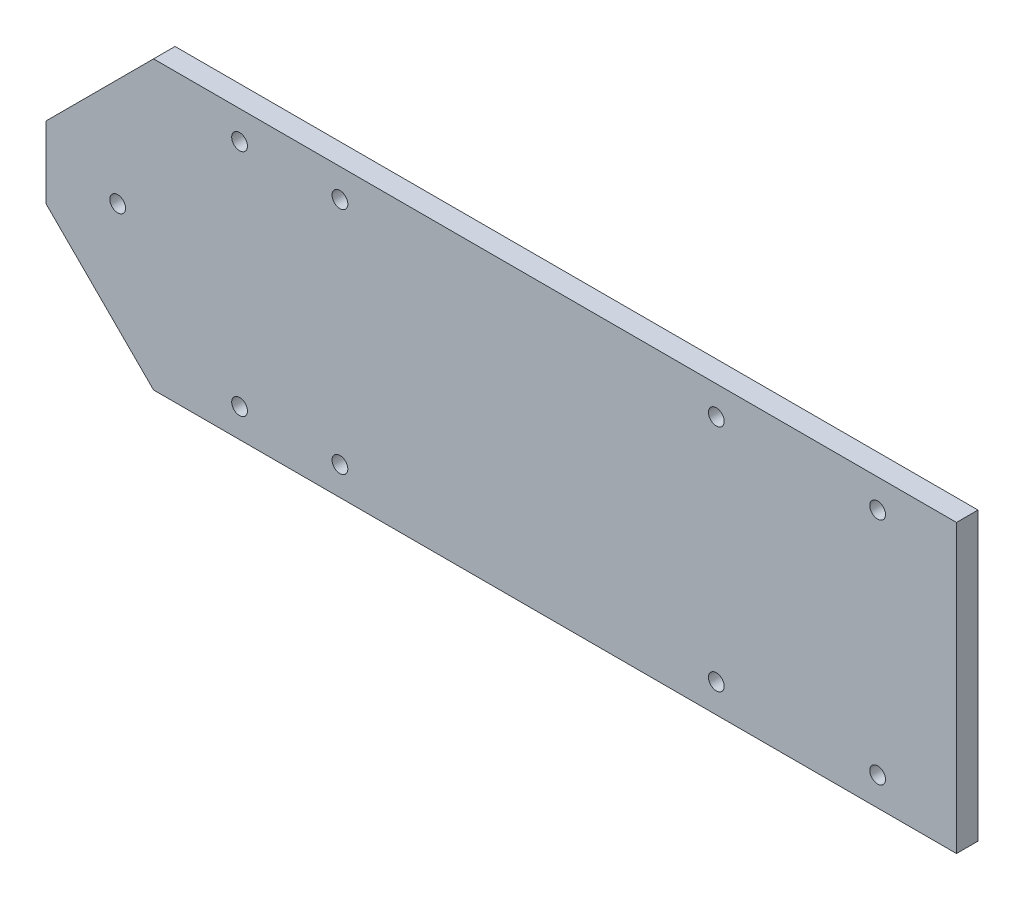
from build123d import *

# Parameters (mm, degrees)
BASE_EXTRUSION_DEPTH    = 3
ESQUISSE2_R             = 1.1
ENL_V_MAT_EXTRU_1_DEPTH = 167.234773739


with BuildPart() as part:
    # Esquisse1 → Base-Extrusion (new body)
    with BuildSketch(Plane.XY):
        Polygon((-165, -5), (-165, 5), (-150, 20), (-38, 20), (-38, -20), (-150, -20), align=None)
    extrude(amount=BASE_EXTRUSION_DEPTH)

    # Esquisse2 → Enl_v. mat.-Extru.1 (cut, through all)
    with BuildSketch(Plane.XY.offset(3)):
        with Locations((-155, 0)):
            Circle(ESQUISSE2_R)
        with Locations((-138, 16)):
            Circle(ESQUISSE2_R)
        with Locations((-124, 16)):
            Circle(ESQUISSE2_R)
        with Locations((-71.5, 16)):
            Circle(ESQUISSE2_R)
        with Locations((-49, 16)):
            Circle(ESQUISSE2_R)
        with Locations(Location((-49, -16, 0), (0, 0, 180))):
            Circle(ESQUISSE2_R)
        with Locations(Location((-71.5, -16, 0), (0, 0, 180))):
            Circle(ESQUISSE2_R)
        with Locations(Location((-124, -16, 0), (0, 0, 180))):
            Circle(ESQUISSE2_R)
        with Locations(Location((-138, -16, 0), (0, 0, 180))):
            Circle(ESQUISSE2_R)
    extrude(amount=-ENL_V_MAT_EXTRU_1_DEPTH, mode=Mode.SUBTRACT)


solid = part.part
